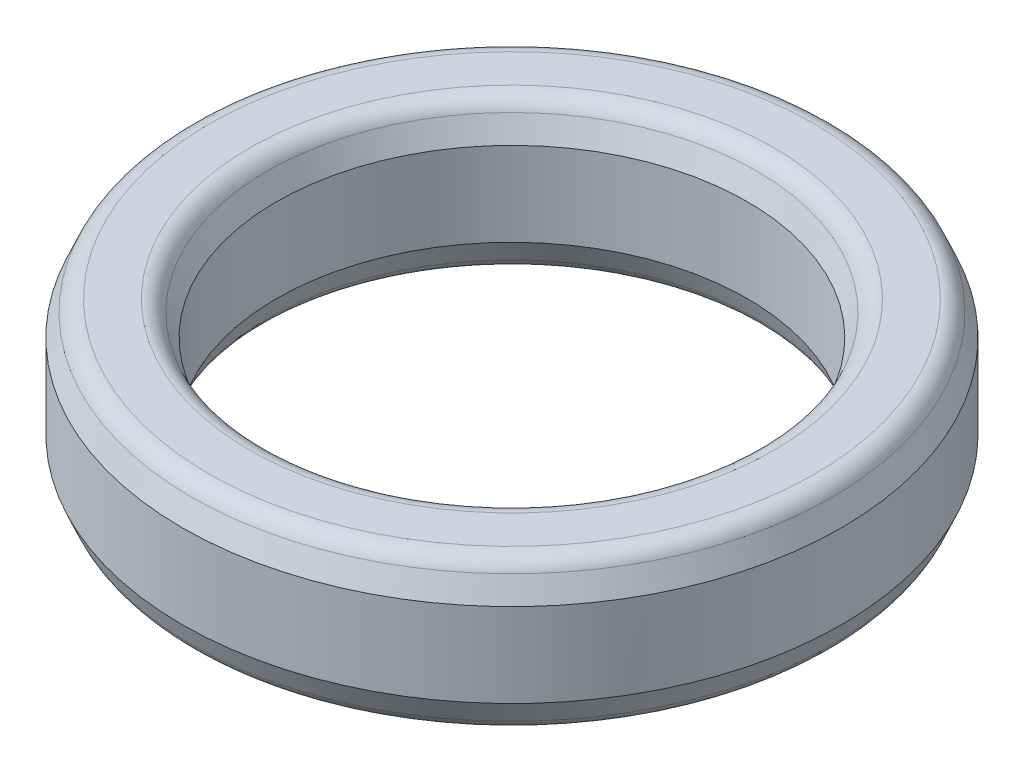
ISO-10303-21;
HEADER;
FILE_DESCRIPTION(('STEP AP214'),'2;1');
FILE_NAME('part.step','',(''),(''),'','','');
FILE_SCHEMA(('AUTOMOTIVE_DESIGN { 1 0 10303 214 1 1 1 1 }'));
ENDSEC;
DATA;
#1=APPLICATION_CONTEXT('core data for automotive mechanical design processes');
#2=APPLICATION_PROTOCOL_DEFINITION('international standard','automotive_design',2000,#1);
#3=PRODUCT_CONTEXT('',#1,'mechanical');
#4=PRODUCT('Part','Part','',(#3));
#5=PRODUCT_RELATED_PRODUCT_CATEGORY('part','',(#4));
#6=PRODUCT_DEFINITION_FORMATION('','',#4);
#7=PRODUCT_DEFINITION_CONTEXT('part definition',#1,'design');
#8=PRODUCT_DEFINITION('design','',#6,#7);
#9=PRODUCT_DEFINITION_SHAPE('','',#8);
#10=(LENGTH_UNIT() NAMED_UNIT(*) SI_UNIT(.MILLI.,.METRE.));
#11=(NAMED_UNIT(*) PLANE_ANGLE_UNIT() SI_UNIT($,.RADIAN.));
#12=(NAMED_UNIT(*) SI_UNIT($,.STERADIAN.) SOLID_ANGLE_UNIT());
#13=UNCERTAINTY_MEASURE_WITH_UNIT(LENGTH_MEASURE(1.E-05),#10,'distance_accuracy_value','');
#14=(GEOMETRIC_REPRESENTATION_CONTEXT(3) GLOBAL_UNCERTAINTY_ASSIGNED_CONTEXT((#13)) GLOBAL_UNIT_ASSIGNED_CONTEXT((#10,
#11,#12)) REPRESENTATION_CONTEXT('',''));
#15=CARTESIAN_POINT('',(0.,0.,0.));
#16=DIRECTION('',(0.,0.,1.));
#17=DIRECTION('',(1.,0.,0.));
#18=AXIS2_PLACEMENT_3D('',#15,#16,#17);
#19=CARTESIAN_POINT('',(23.8125,-3.53758344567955,0.));
#20=DIRECTION('',(0.,1.,0.));
#21=DIRECTION('',(0.,0.,1.));
#22=AXIS2_PLACEMENT_3D('',#19,#20,#21);
#23=CONICAL_SURFACE('',#22,27.78125,0.401425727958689);
#24=CARTESIAN_POINT('',(23.8125,-5.38278566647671,0.));
#25=DIRECTION('',(0.,-1.,0.));
#26=DIRECTION('',(0.,0.,-1.));
#27=AXIS2_PLACEMENT_3D('',#24,#25,#26);
#28=CIRCLE('',#27,26.9980081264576);
#29=CARTESIAN_POINT('',(23.8125,-5.38278566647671,-26.9980081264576));
#30=VERTEX_POINT('',#29);
#31=EDGE_CURVE('E61',#30,#30,#28,.F.);
#32=ORIENTED_EDGE('',*,*,#31,.T.);
#33=EDGE_LOOP('',(#32));
#34=FACE_BOUND('',#33,.T.);
#35=CARTESIAN_POINT('',(23.8125,-3.53758344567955,0.));
#36=DIRECTION('',(0.,1.,0.));
#37=DIRECTION('',(0.,0.,1.));
#38=AXIS2_PLACEMENT_3D('',#35,#36,#37);
#39=CIRCLE('',#38,27.78125);
#40=CARTESIAN_POINT('',(23.8125,-3.53758344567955,27.78125));
#41=VERTEX_POINT('',#40);
#42=EDGE_CURVE('E73',#41,#41,#39,.T.);
#43=ORIENTED_EDGE('',*,*,#42,.F.);
#44=EDGE_LOOP('',(#43));
#45=FACE_BOUND('',#44,.T.);
#46=ADVANCED_FACE('F32',(#34,#45),#23,.T.);
#47=CARTESIAN_POINT('',(-2.77495,-6.35,0.));
#48=DIRECTION('',(0.,-1.,0.));
#49=DIRECTION('',(0.,0.,-1.));
#50=AXIS2_PLACEMENT_3D('',#47,#48,#49);
#51=PLANE('',#50);
#52=CARTESIAN_POINT('',(23.8125,-6.35,0.));
#53=DIRECTION('',(0.,-1.,0.));
#54=DIRECTION('',(0.,0.,-1.));
#55=AXIS2_PLACEMENT_3D('',#52,#53,#54);
#56=CIRCLE('',#55,25.5367066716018);
#57=CARTESIAN_POINT('',(23.8125,-6.35,-25.5367066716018));
#58=VERTEX_POINT('',#57);
#59=EDGE_CURVE('E55',#58,#58,#56,.T.);
#60=ORIENTED_EDGE('',*,*,#59,.T.);
#61=EDGE_LOOP('',(#60));
#62=FACE_BOUND('',#61,.T.);
#63=CARTESIAN_POINT('',(23.8125,-6.35,0.));
#64=DIRECTION('',(0.,-1.,0.));
#65=DIRECTION('',(0.,0.,-1.));
#66=AXIS2_PLACEMENT_3D('',#63,#64,#65);
#67=CIRCLE('',#66,22.0882933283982);
#68=CARTESIAN_POINT('',(23.8125,-6.35,-22.0882933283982));
#69=VERTEX_POINT('',#68);
#70=EDGE_CURVE('E58',#69,#69,#67,.F.);
#71=ORIENTED_EDGE('',*,*,#70,.T.);
#72=EDGE_LOOP('',(#71));
#73=FACE_BOUND('',#72,.T.);
#74=ADVANCED_FACE('F81',(#62,#73),#51,.T.);
#75=CARTESIAN_POINT('',(23.8125,-6.35,0.));
#76=DIRECTION('',(0.,-1.,0.));
#77=DIRECTION('',(0.,0.,-1.));
#78=AXIS2_PLACEMENT_3D('',#75,#76,#77);
#79=CONICAL_SURFACE('',#78,21.03755,0.40142572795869);
#80=CARTESIAN_POINT('',(23.8125,-5.38278566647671,0.));
#81=DIRECTION('',(0.,1.,0.));
#82=DIRECTION('',(0.,0.,1.));
#83=AXIS2_PLACEMENT_3D('',#80,#81,#82);
#84=CIRCLE('',#83,20.6269918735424);
#85=CARTESIAN_POINT('',(23.8125,-5.38278566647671,20.6269918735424));
#86=VERTEX_POINT('',#85);
#87=EDGE_CURVE('E52',#86,#86,#84,.F.);
#88=ORIENTED_EDGE('',*,*,#87,.T.);
#89=EDGE_LOOP('',(#88));
#90=FACE_BOUND('',#89,.T.);
#91=CARTESIAN_POINT('',(23.8125,-3.53758344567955,0.));
#92=DIRECTION('',(0.,1.,0.));
#93=DIRECTION('',(0.,0.,1.));
#94=AXIS2_PLACEMENT_3D('',#91,#92,#93);
#95=CIRCLE('',#94,19.84375);
#96=CARTESIAN_POINT('',(23.8125,-3.53758344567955,19.84375));
#97=VERTEX_POINT('',#96);
#98=EDGE_CURVE('E64',#97,#97,#95,.T.);
#99=ORIENTED_EDGE('',*,*,#98,.T.);
#100=EDGE_LOOP('',(#99));
#101=FACE_BOUND('',#100,.T.);
#102=ADVANCED_FACE('F87',(#90,#101),#79,.F.);
#103=CARTESIAN_POINT('',(23.8125,24.4422276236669,0.));
#104=DIRECTION('',(0.,1.,0.));
#105=DIRECTION('',(0.,0.,1.));
#106=AXIS2_PLACEMENT_3D('',#103,#104,#105);
#107=CYLINDRICAL_SURFACE('',#106,19.84375);
#108=ORIENTED_EDGE('',*,*,#98,.F.);
#109=EDGE_LOOP('',(#108));
#110=FACE_BOUND('',#109,.T.);
#111=CARTESIAN_POINT('',(23.8125,3.53758344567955,0.));
#112=DIRECTION('',(0.,1.,0.));
#113=DIRECTION('',(0.,0.,1.));
#114=AXIS2_PLACEMENT_3D('',#111,#112,#113);
#115=CIRCLE('',#114,19.84375);
#116=CARTESIAN_POINT('',(23.8125,3.53758344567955,19.84375));
#117=VERTEX_POINT('',#116);
#118=EDGE_CURVE('E67',#117,#117,#115,.T.);
#119=ORIENTED_EDGE('',*,*,#118,.T.);
#120=EDGE_LOOP('',(#119));
#121=FACE_BOUND('',#120,.T.);
#122=ADVANCED_FACE('F113',(#110,#121),#107,.F.);
#123=CARTESIAN_POINT('',(23.8125,6.35,0.));
#124=DIRECTION('',(0.,1.,0.));
#125=DIRECTION('',(0.,0.,1.));
#126=AXIS2_PLACEMENT_3D('',#123,#124,#125);
#127=CONICAL_SURFACE('',#126,21.03755,0.40142572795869);
#128=CARTESIAN_POINT('',(23.8125,5.38278566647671,0.));
#129=DIRECTION('',(0.,-1.,0.));
#130=DIRECTION('',(0.,0.,-1.));
#131=AXIS2_PLACEMENT_3D('',#128,#129,#130);
#132=CIRCLE('',#131,20.6269918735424);
#133=CARTESIAN_POINT('',(23.8125,5.38278566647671,-20.6269918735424));
#134=VERTEX_POINT('',#133);
#135=EDGE_CURVE('E47',#134,#134,#132,.F.);
#136=ORIENTED_EDGE('',*,*,#135,.T.);
#137=EDGE_LOOP('',(#136));
#138=FACE_BOUND('',#137,.T.);
#139=ORIENTED_EDGE('',*,*,#118,.F.);
#140=EDGE_LOOP('',(#139));
#141=FACE_BOUND('',#140,.T.);
#142=ADVANCED_FACE('F109',(#138,#141),#127,.F.);
#143=CARTESIAN_POINT('',(-2.77495,6.35,0.));
#144=DIRECTION('',(0.,-1.,0.));
#145=DIRECTION('',(0.,0.,-1.));
#146=AXIS2_PLACEMENT_3D('',#143,#144,#145);
#147=PLANE('',#146);
#148=CARTESIAN_POINT('',(23.8125,6.35,0.));
#149=DIRECTION('',(0.,-1.,0.));
#150=DIRECTION('',(0.,0.,-1.));
#151=AXIS2_PLACEMENT_3D('',#148,#149,#150);
#152=CIRCLE('',#151,22.0882933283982);
#153=CARTESIAN_POINT('',(23.8125,6.35,-22.0882933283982));
#154=VERTEX_POINT('',#153);
#155=EDGE_CURVE('E39',#154,#154,#152,.T.);
#156=ORIENTED_EDGE('',*,*,#155,.T.);
#157=EDGE_LOOP('',(#156));
#158=FACE_BOUND('',#157,.T.);
#159=CARTESIAN_POINT('',(23.8125,6.35,0.));
#160=DIRECTION('',(0.,-1.,0.));
#161=DIRECTION('',(0.,0.,-1.));
#162=AXIS2_PLACEMENT_3D('',#159,#160,#161);
#163=CIRCLE('',#162,25.5367066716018);
#164=CARTESIAN_POINT('',(23.8125,6.35,-25.5367066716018));
#165=VERTEX_POINT('',#164);
#166=EDGE_CURVE('E43',#165,#165,#163,.F.);
#167=ORIENTED_EDGE('',*,*,#166,.T.);
#168=EDGE_LOOP('',(#167));
#169=FACE_BOUND('',#168,.T.);
#170=ADVANCED_FACE('F112',(#158,#169),#147,.F.);
#171=CARTESIAN_POINT('',(23.8125,6.35,0.));
#172=DIRECTION('',(0.,-1.,0.));
#173=DIRECTION('',(0.,0.,-1.));
#174=AXIS2_PLACEMENT_3D('',#171,#172,#173);
#175=CONICAL_SURFACE('',#174,26.58745,0.401425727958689);
#176=CARTESIAN_POINT('',(23.8125,5.38278566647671,0.));
#177=DIRECTION('',(0.,-1.,0.));
#178=DIRECTION('',(0.,0.,-1.));
#179=AXIS2_PLACEMENT_3D('',#176,#177,#178);
#180=CIRCLE('',#179,26.9980081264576);
#181=CARTESIAN_POINT('',(23.8125,5.38278566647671,-26.9980081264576));
#182=VERTEX_POINT('',#181);
#183=EDGE_CURVE('E10',#182,#182,#180,.T.);
#184=ORIENTED_EDGE('',*,*,#183,.T.);
#185=EDGE_LOOP('',(#184));
#186=FACE_BOUND('',#185,.T.);
#187=CARTESIAN_POINT('',(23.8125,3.53758344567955,0.));
#188=DIRECTION('',(0.,1.,0.));
#189=DIRECTION('',(0.,0.,1.));
#190=AXIS2_PLACEMENT_3D('',#187,#188,#189);
#191=CIRCLE('',#190,27.78125);
#192=CARTESIAN_POINT('',(23.8125,3.53758344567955,27.78125));
#193=VERTEX_POINT('',#192);
#194=EDGE_CURVE('E70',#193,#193,#191,.T.);
#195=ORIENTED_EDGE('',*,*,#194,.T.);
#196=EDGE_LOOP('',(#195));
#197=FACE_BOUND('',#196,.T.);
#198=ADVANCED_FACE('F128',(#186,#197),#175,.T.);
#199=CARTESIAN_POINT('',(23.8125,24.4422276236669,0.));
#200=DIRECTION('',(0.,1.,0.));
#201=DIRECTION('',(0.,0.,1.));
#202=AXIS2_PLACEMENT_3D('',#199,#200,#201);
#203=CYLINDRICAL_SURFACE('',#202,27.78125);
#204=ORIENTED_EDGE('',*,*,#42,.T.);
#205=EDGE_LOOP('',(#204));
#206=FACE_BOUND('',#205,.T.);
#207=ORIENTED_EDGE('',*,*,#194,.F.);
#208=EDGE_LOOP('',(#207));
#209=FACE_BOUND('',#208,.T.);
#210=ADVANCED_FACE('F77',(#206,#209),#203,.T.);
#211=CARTESIAN_POINT('',(23.8125,-4.7625,0.));
#212=DIRECTION('',(0.,-1.,0.));
#213=DIRECTION('',(0.,0.,-1.));
#214=AXIS2_PLACEMENT_3D('',#211,#212,#213);
#215=TOROIDAL_SURFACE('',#214,25.5367066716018,1.5875);
#216=ORIENTED_EDGE('',*,*,#59,.F.);
#217=EDGE_LOOP('',(#216));
#218=FACE_BOUND('',#217,.T.);
#219=ORIENTED_EDGE('',*,*,#31,.F.);
#220=EDGE_LOOP('',(#219));
#221=FACE_BOUND('',#220,.T.);
#222=ADVANCED_FACE('F92',(#218,#221),#215,.T.);
#223=CARTESIAN_POINT('',(23.8125,-4.7625,0.));
#224=DIRECTION('',(0.,-1.,0.));
#225=DIRECTION('',(0.,0.,-1.));
#226=AXIS2_PLACEMENT_3D('',#223,#224,#225);
#227=TOROIDAL_SURFACE('',#226,22.0882933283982,1.5875);
#228=ORIENTED_EDGE('',*,*,#87,.F.);
#229=EDGE_LOOP('',(#228));
#230=FACE_BOUND('',#229,.T.);
#231=ORIENTED_EDGE('',*,*,#70,.F.);
#232=EDGE_LOOP('',(#231));
#233=FACE_BOUND('',#232,.T.);
#234=ADVANCED_FACE('F95',(#230,#233),#227,.T.);
#235=CARTESIAN_POINT('',(23.8125,4.7625,0.));
#236=DIRECTION('',(0.,-1.,0.));
#237=DIRECTION('',(0.,0.,-1.));
#238=AXIS2_PLACEMENT_3D('',#235,#236,#237);
#239=TOROIDAL_SURFACE('',#238,22.0882933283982,1.5875);
#240=ORIENTED_EDGE('',*,*,#155,.F.);
#241=EDGE_LOOP('',(#240));
#242=FACE_BOUND('',#241,.T.);
#243=ORIENTED_EDGE('',*,*,#135,.F.);
#244=EDGE_LOOP('',(#243));
#245=FACE_BOUND('',#244,.T.);
#246=ADVANCED_FACE('F98',(#242,#245),#239,.T.);
#247=CARTESIAN_POINT('',(23.8125,4.7625,0.));
#248=DIRECTION('',(0.,-1.,0.));
#249=DIRECTION('',(0.,0.,-1.));
#250=AXIS2_PLACEMENT_3D('',#247,#248,#249);
#251=TOROIDAL_SURFACE('',#250,25.5367066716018,1.5875);
#252=ORIENTED_EDGE('',*,*,#183,.F.);
#253=EDGE_LOOP('',(#252));
#254=FACE_BOUND('',#253,.T.);
#255=ORIENTED_EDGE('',*,*,#166,.F.);
#256=EDGE_LOOP('',(#255));
#257=FACE_BOUND('',#256,.T.);
#258=ADVANCED_FACE('F34',(#254,#257),#251,.T.);
#259=CLOSED_SHELL('',(#46,#74,#102,#122,#142,#170,#198,#210,#222,#234,#246,#258));
#260=MANIFOLD_SOLID_BREP('B2',#259);
#261=ADVANCED_BREP_SHAPE_REPRESENTATION('',(#18,#260),#14);
#262=SHAPE_DEFINITION_REPRESENTATION(#9,#261);
ENDSEC;
END-ISO-10303-21;
